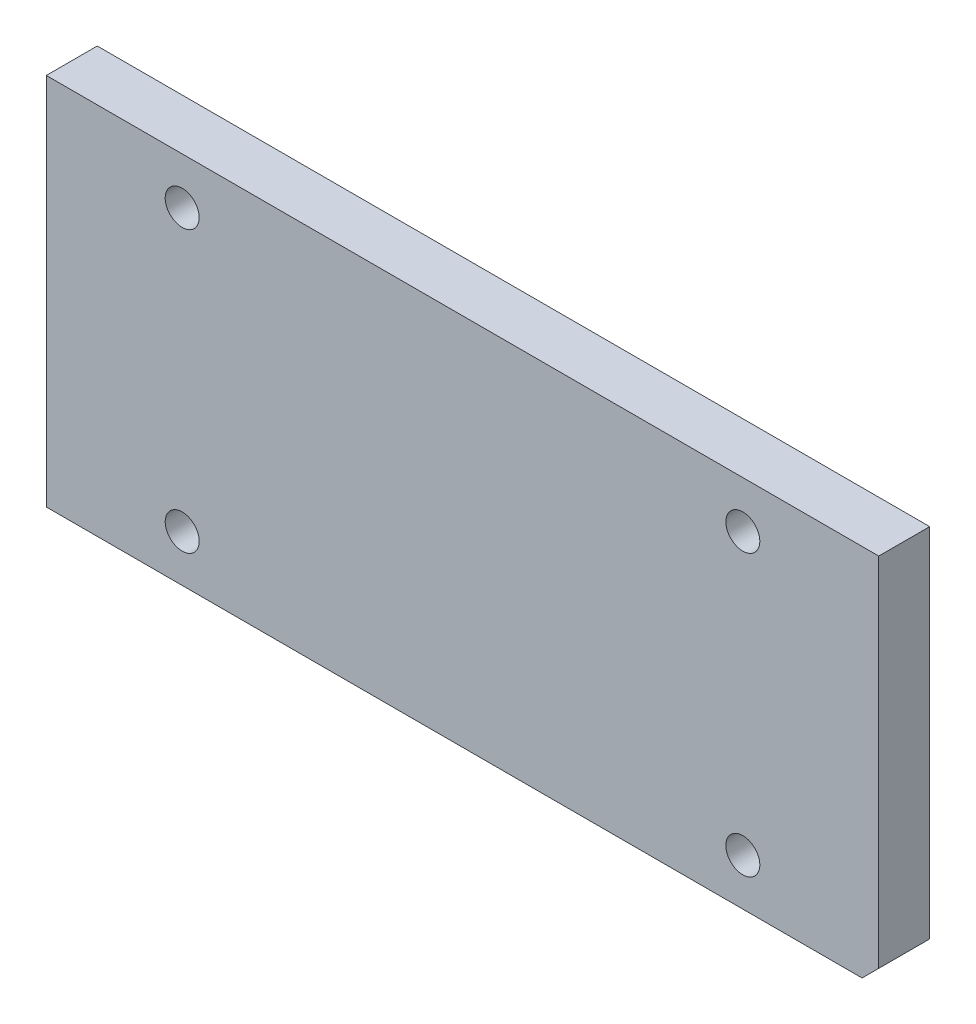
from build123d import *

# Parameters (mm, degrees)
SKETCH1_W                = 196
SKETCH1_H                = 88
BOSS_EXTRUDE1_DEPTH      = 12
TAPPED_HOLE1_D           = 6.8
TAPPED_HOLE1_DEPTH       = 14.857073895
TAPPED_HOLE1_CBORE_D     = 8
TAPPED_HOLE1_CBORE_DEPTH = 11.9
TAPPED_HOLE1_TIP         = 2.042926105
CHAMFER1_SIZE            = 3.92


with BuildPart() as part:
    # Sketch1 → Boss-Extrude1 (new body)
    with BuildSketch(Plane.XY):
        Rectangle(SKETCH1_W, SKETCH1_H)
    extrude(amount=-BOSS_EXTRUDE1_DEPTH)

    # Tapped Hole1
    with Locations(Plane(origin=(-522.991452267, 0, 0), x_dir=(1, 0, 0), z_dir=(0, 0, 1))):
        with Locations((588.991452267, 33), (588.991452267, -33), (456.991452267, -33), (456.991452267, 33)):
            CounterBoreHole(TAPPED_HOLE1_D / 2, TAPPED_HOLE1_CBORE_D / 2, TAPPED_HOLE1_CBORE_DEPTH, depth=TAPPED_HOLE1_DEPTH)
            with Locations((0, 0, -(TAPPED_HOLE1_DEPTH + TAPPED_HOLE1_TIP / 2))):  # 118° drill point
                Cone(0, TAPPED_HOLE1_D / 2, TAPPED_HOLE1_TIP, mode=Mode.SUBTRACT)

    # Chamfer1
    chamfer1_edges = [part.edges().sort_by_distance(p)[0] for p in [
        (98, -44, -6),
    ]]
    chamfer(chamfer1_edges, length=CHAMFER1_SIZE)


solid = part.part
